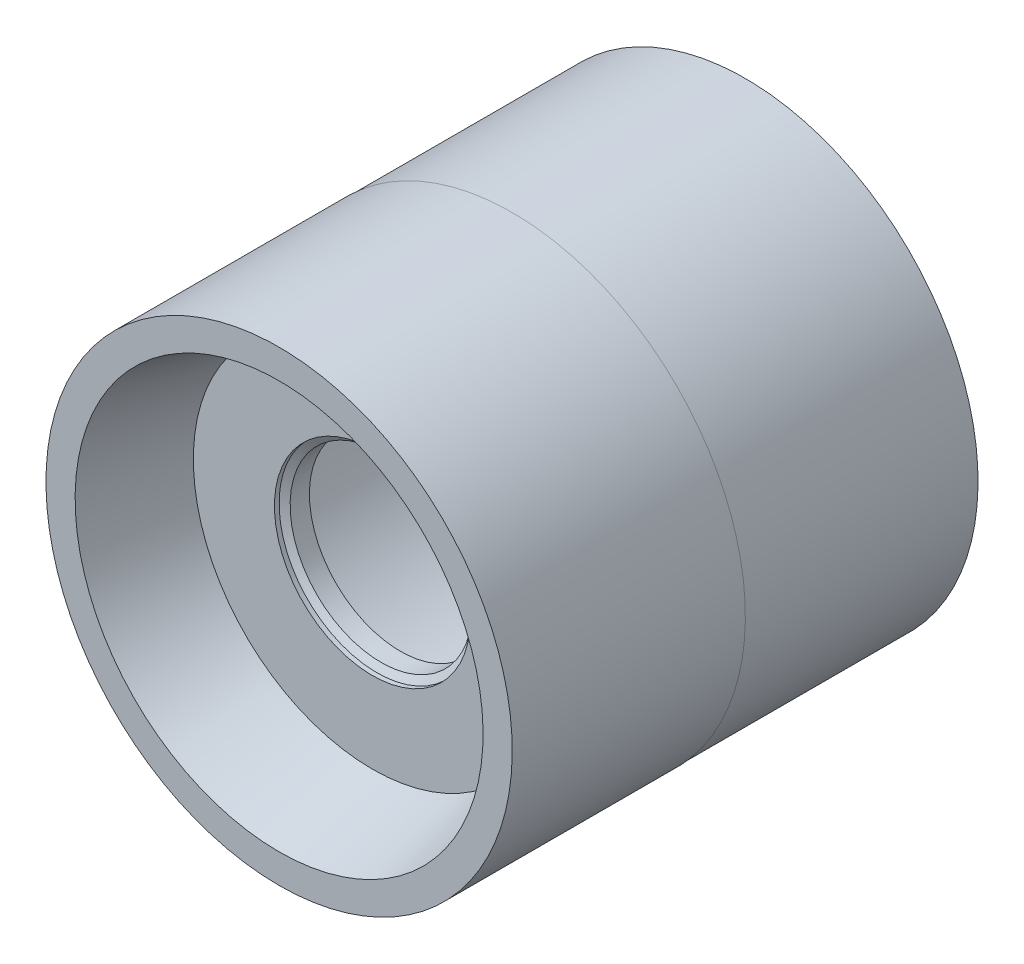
from build123d import *

# Parameters (mm, degrees)
SKETCH3_R           = 4.953
EXTRUDE1_DEPTH      = 32.108519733
SKETCH4_R           = 5.334
EXTRUDE2_DEPTH      = 0.254
EXTRUDE4_DEPTH      = 12.192
EXTRUDE4_DEPTH_BACK = 12.192
SKETCH7_R           = 10.033
EXTRUDE5_DEPTH      = 18.796


with BuildPart() as part:
    # Sketch2 → Revolve1 (revolve)
    with BuildSketch(Plane(origin=(0, 0, 0), x_dir=(0, 0, -1), z_dir=(1, 0, 0)), mode=Mode.PRIVATE) as revolve1_sk:
        Polygon((0, 11.1125), (0, 12.7), (12.7, 12.7), (12.7, 12.6746), (25.4, 12.6746), (25.4, 0), (5.08, 0), (5.08, 9.751318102), align=None)
    revolve(revolve1_sk.sketch.rotate(Axis((0, 0, 0), (0, 0, -1)), 180), axis=Axis((0, 0, 0), (0, 0, -1)))

    # Sketch3 → Extrude1 (cut, through all)
    with BuildSketch(Plane(origin=(0, 0, -25.4), x_dir=(-1, 0, 0), z_dir=(0, 0, -1))):
        with Locations(Location((0, 0, 0), (0, 0, 90))):
            Circle(SKETCH3_R)
    extrude(amount=-EXTRUDE1_DEPTH, mode=Mode.SUBTRACT)

    # Sketch4 → Extrude2 (cut)
    with BuildSketch(Plane.XY.offset(-5.08)):
        Circle(SKETCH4_R)
    extrude(amount=-EXTRUDE2_DEPTH, mode=Mode.SUBTRACT)

    # Extrude3 cone 1 section (on through the dimple's axis) → Extrude3 (revolve, cut)
    with BuildSketch(Plane(origin=(0, 0, -5.334), x_dir=(0, -1, 0), z_dir=(1, 0, 0))):
        Polygon((0, 0), (5.334, 0), (0, 3.079586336), align=None)
    revolve(axis=Axis((0, 0, -5.334), (0, 0, -1)), mode=Mode.SUBTRACT)

    # Sketch6 → Extrude4 (cut, two sides: drawn at the far end of the back side and taken through both)
    with BuildSketch(Plane(origin=(0, 0, 0), x_dir=(1, 0, 0), z_dir=(0, 1, 0)).offset(-EXTRUDE4_DEPTH_BACK)):
        with BuildLine():
            Line((-0.127, 28.194), (0.127, 28.194))
            ThreePointArc((0.127, 28.194), (1.294433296, 27.710433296), (1.778, 26.543))
            Line((1.778, 26.543), (1.778, 20.828))
            ThreePointArc((1.778, 20.828), (1.294433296, 19.660566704), (0.127, 19.177))
            Line((0.127, 19.177), (-0.127, 19.177))
            ThreePointArc((-0.127, 19.177), (-1.294433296, 19.660566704), (-1.778, 20.828))
            Line((-1.778, 20.828), (-1.778, 26.543))
            ThreePointArc((-1.778, 26.543), (-1.294433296, 27.710433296), (-0.127, 28.194))
        make_face()
    extrude(amount=EXTRUDE4_DEPTH + EXTRUDE4_DEPTH_BACK, mode=Mode.SUBTRACT)

    # Sketch7 → Extrude5 (cut)
    with BuildSketch(Plane(origin=(0, 0, -25.4), x_dir=(-1, 0, 0), z_dir=(0, 0, -1))):
        with Locations(Location((0, 0, 0), (0, 0, 90))):
            Circle(SKETCH7_R)
    extrude(amount=-EXTRUDE5_DEPTH, mode=Mode.SUBTRACT)


solid = part.part
